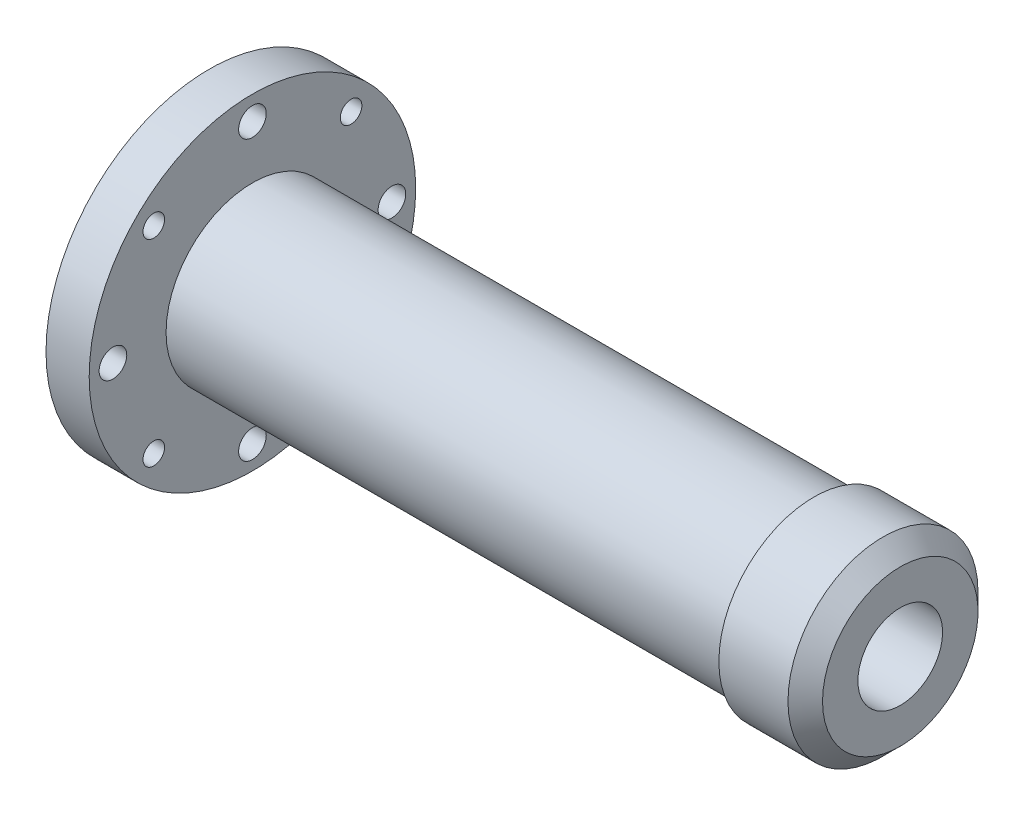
ISO-10303-21;
HEADER;
FILE_DESCRIPTION(('STEP AP214'),'2;1');
FILE_NAME('part.step','',(''),(''),'','','');
FILE_SCHEMA(('AUTOMOTIVE_DESIGN { 1 0 10303 214 1 1 1 1 }'));
ENDSEC;
DATA;
#1=APPLICATION_CONTEXT('core data for automotive mechanical design processes');
#2=APPLICATION_PROTOCOL_DEFINITION('international standard','automotive_design',2000,#1);
#3=PRODUCT_CONTEXT('',#1,'mechanical');
#4=PRODUCT('Part','Part','',(#3));
#5=PRODUCT_RELATED_PRODUCT_CATEGORY('part','',(#4));
#6=PRODUCT_DEFINITION_FORMATION('','',#4);
#7=PRODUCT_DEFINITION_CONTEXT('part definition',#1,'design');
#8=PRODUCT_DEFINITION('design','',#6,#7);
#9=PRODUCT_DEFINITION_SHAPE('','',#8);
#10=(LENGTH_UNIT() NAMED_UNIT(*) SI_UNIT(.MILLI.,.METRE.));
#11=(NAMED_UNIT(*) PLANE_ANGLE_UNIT() SI_UNIT($,.RADIAN.));
#12=(NAMED_UNIT(*) SI_UNIT($,.STERADIAN.) SOLID_ANGLE_UNIT());
#13=UNCERTAINTY_MEASURE_WITH_UNIT(LENGTH_MEASURE(1.E-05),#10,'distance_accuracy_value','');
#14=(GEOMETRIC_REPRESENTATION_CONTEXT(3) GLOBAL_UNCERTAINTY_ASSIGNED_CONTEXT((#13)) GLOBAL_UNIT_ASSIGNED_CONTEXT((#10,
#11,#12)) REPRESENTATION_CONTEXT('',''));
#15=CARTESIAN_POINT('',(0.,0.,0.));
#16=DIRECTION('',(0.,0.,1.));
#17=DIRECTION('',(1.,0.,0.));
#18=AXIS2_PLACEMENT_3D('',#15,#16,#17);
#19=CARTESIAN_POINT('',(0.,13.5,0.));
#20=DIRECTION('',(1.,0.,0.));
#21=DIRECTION('',(0.,0.,-1.));
#22=AXIS2_PLACEMENT_3D('',#19,#20,#21);
#23=PLANE('',#22);
#24=CARTESIAN_POINT('',(0.,-11.4197745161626,11.4197745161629));
#25=DIRECTION('',(-1.,0.,0.));
#26=DIRECTION('',(0.,0.,1.));
#27=AXIS2_PLACEMENT_3D('',#24,#25,#26);
#28=CIRCLE('',#27,1.24999999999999);
#29=CARTESIAN_POINT('',(0.,-11.4197745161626,12.6697745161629));
#30=VERTEX_POINT('',#29);
#31=EDGE_CURVE('E251',#30,#30,#28,.T.);
#32=ORIENTED_EDGE('',*,*,#31,.F.);
#33=EDGE_LOOP('',(#32));
#34=FACE_BOUND('',#33,.T.);
#35=CARTESIAN_POINT('',(0.,11.4197745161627,-11.4197745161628));
#36=DIRECTION('',(-1.,0.,0.));
#37=DIRECTION('',(0.,0.,1.));
#38=AXIS2_PLACEMENT_3D('',#35,#36,#37);
#39=CIRCLE('',#38,1.24999999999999);
#40=CARTESIAN_POINT('',(0.,11.4197745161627,-10.1697745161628));
#41=VERTEX_POINT('',#40);
#42=EDGE_CURVE('E107',#41,#41,#39,.T.);
#43=ORIENTED_EDGE('',*,*,#42,.F.);
#44=EDGE_LOOP('',(#43));
#45=FACE_BOUND('',#44,.T.);
#46=CARTESIAN_POINT('',(0.,0.,-16.15));
#47=DIRECTION('',(1.,0.,0.));
#48=DIRECTION('',(0.,0.,-1.));
#49=AXIS2_PLACEMENT_3D('',#46,#47,#48);
#50=CIRCLE('',#49,1.59999999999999);
#51=CARTESIAN_POINT('',(0.,0.,-17.75));
#52=VERTEX_POINT('',#51);
#53=EDGE_CURVE('E122',#52,#52,#50,.T.);
#54=ORIENTED_EDGE('',*,*,#53,.T.);
#55=EDGE_LOOP('',(#54));
#56=FACE_BOUND('',#55,.T.);
#57=CARTESIAN_POINT('',(0.,0.,0.));
#58=DIRECTION('',(-1.,0.,0.));
#59=DIRECTION('',(0.,0.,1.));
#60=AXIS2_PLACEMENT_3D('',#57,#58,#59);
#61=CIRCLE('',#60,13.5);
#62=CARTESIAN_POINT('',(0.,0.,13.5));
#63=VERTEX_POINT('',#62);
#64=EDGE_CURVE('E157',#63,#63,#61,.T.);
#65=ORIENTED_EDGE('',*,*,#64,.F.);
#66=EDGE_LOOP('',(#65));
#67=FACE_BOUND('',#66,.T.);
#68=CARTESIAN_POINT('',(0.,0.,0.));
#69=DIRECTION('',(-1.,0.,0.));
#70=DIRECTION('',(0.,0.,1.));
#71=AXIS2_PLACEMENT_3D('',#68,#69,#70);
#72=CIRCLE('',#71,18.9);
#73=CARTESIAN_POINT('',(0.,0.,18.9));
#74=VERTEX_POINT('',#73);
#75=EDGE_CURVE('E154',#74,#74,#72,.T.);
#76=ORIENTED_EDGE('',*,*,#75,.T.);
#77=EDGE_LOOP('',(#76));
#78=FACE_BOUND('',#77,.T.);
#79=CARTESIAN_POINT('',(0.,-16.15,0.));
#80=DIRECTION('',(1.,0.,0.));
#81=DIRECTION('',(0.,0.,-1.));
#82=AXIS2_PLACEMENT_3D('',#79,#80,#81);
#83=CIRCLE('',#82,1.59999999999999);
#84=CARTESIAN_POINT('',(0.,-16.15,-1.59999999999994));
#85=VERTEX_POINT('',#84);
#86=EDGE_CURVE('E104',#85,#85,#83,.T.);
#87=ORIENTED_EDGE('',*,*,#86,.T.);
#88=EDGE_LOOP('',(#87));
#89=FACE_BOUND('',#88,.T.);
#90=CARTESIAN_POINT('',(0.,1.12774847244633E-13,16.15));
#91=DIRECTION('',(1.,0.,0.));
#92=DIRECTION('',(0.,0.,-1.));
#93=AXIS2_PLACEMENT_3D('',#90,#91,#92);
#94=CIRCLE('',#93,1.59999999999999);
#95=CARTESIAN_POINT('',(0.,1.12774847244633E-13,14.55));
#96=VERTEX_POINT('',#95);
#97=EDGE_CURVE('E98',#96,#96,#94,.T.);
#98=ORIENTED_EDGE('',*,*,#97,.T.);
#99=EDGE_LOOP('',(#98));
#100=FACE_BOUND('',#99,.T.);
#101=CARTESIAN_POINT('',(0.,16.15,-1.6916227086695E-13));
#102=DIRECTION('',(1.,0.,0.));
#103=DIRECTION('',(0.,0.,-1.));
#104=AXIS2_PLACEMENT_3D('',#101,#102,#103);
#105=CIRCLE('',#104,1.59999999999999);
#106=CARTESIAN_POINT('',(0.,16.15,-1.60000000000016));
#107=VERTEX_POINT('',#106);
#108=EDGE_CURVE('E92',#107,#107,#105,.T.);
#109=ORIENTED_EDGE('',*,*,#108,.T.);
#110=EDGE_LOOP('',(#109));
#111=FACE_BOUND('',#110,.T.);
#112=CARTESIAN_POINT('',(0.,-11.4197745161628,-11.4197745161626));
#113=DIRECTION('',(-1.,0.,0.));
#114=DIRECTION('',(0.,0.,1.));
#115=AXIS2_PLACEMENT_3D('',#112,#113,#114);
#116=CIRCLE('',#115,1.24999999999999);
#117=CARTESIAN_POINT('',(0.,-11.4197745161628,-10.1697745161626));
#118=VERTEX_POINT('',#117);
#119=EDGE_CURVE('E243',#118,#118,#116,.T.);
#120=ORIENTED_EDGE('',*,*,#119,.F.);
#121=EDGE_LOOP('',(#120));
#122=FACE_BOUND('',#121,.T.);
#123=CARTESIAN_POINT('',(0.,11.4197745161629,11.4197745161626));
#124=DIRECTION('',(-1.,0.,0.));
#125=DIRECTION('',(0.,0.,1.));
#126=AXIS2_PLACEMENT_3D('',#123,#124,#125);
#127=CIRCLE('',#126,1.24999999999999);
#128=CARTESIAN_POINT('',(0.,11.4197745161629,12.6697745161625));
#129=VERTEX_POINT('',#128);
#130=EDGE_CURVE('E246',#129,#129,#127,.T.);
#131=ORIENTED_EDGE('',*,*,#130,.F.);
#132=EDGE_LOOP('',(#131));
#133=FACE_BOUND('',#132,.T.);
#134=ADVANCED_FACE('F39',(#34,#45,#56,#67,#78,#89,#100,#111,#122,#133),#23,.F.);
#135=CARTESIAN_POINT('',(5.,18.9,0.));
#136=DIRECTION('',(-1.,0.,0.));
#137=DIRECTION('',(0.,0.,1.));
#138=AXIS2_PLACEMENT_3D('',#135,#136,#137);
#139=PLANE('',#138);
#140=CARTESIAN_POINT('',(5.,11.4197745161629,11.4197745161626));
#141=DIRECTION('',(-1.,0.,0.));
#142=DIRECTION('',(0.,0.,1.));
#143=AXIS2_PLACEMENT_3D('',#140,#141,#142);
#144=CIRCLE('',#143,1.24999999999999);
#145=CARTESIAN_POINT('',(5.,11.4197745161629,12.6697745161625));
#146=VERTEX_POINT('',#145);
#147=EDGE_CURVE('E248',#146,#146,#144,.T.);
#148=ORIENTED_EDGE('',*,*,#147,.T.);
#149=EDGE_LOOP('',(#148));
#150=FACE_BOUND('',#149,.T.);
#151=CARTESIAN_POINT('',(5.,-11.4197745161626,11.4197745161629));
#152=DIRECTION('',(-1.,0.,0.));
#153=DIRECTION('',(0.,0.,1.));
#154=AXIS2_PLACEMENT_3D('',#151,#152,#153);
#155=CIRCLE('',#154,1.24999999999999);
#156=CARTESIAN_POINT('',(5.,-11.4197745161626,12.6697745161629));
#157=VERTEX_POINT('',#156);
#158=EDGE_CURVE('E256',#157,#157,#155,.T.);
#159=ORIENTED_EDGE('',*,*,#158,.T.);
#160=EDGE_LOOP('',(#159));
#161=FACE_BOUND('',#160,.T.);
#162=CARTESIAN_POINT('',(5.,-11.4197745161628,-11.4197745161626));
#163=DIRECTION('',(-1.,0.,0.));
#164=DIRECTION('',(0.,0.,1.));
#165=AXIS2_PLACEMENT_3D('',#162,#163,#164);
#166=CIRCLE('',#165,1.24999999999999);
#167=CARTESIAN_POINT('',(5.,-11.4197745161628,-10.1697745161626));
#168=VERTEX_POINT('',#167);
#169=EDGE_CURVE('E77',#168,#168,#166,.T.);
#170=ORIENTED_EDGE('',*,*,#169,.T.);
#171=EDGE_LOOP('',(#170));
#172=FACE_BOUND('',#171,.T.);
#173=CARTESIAN_POINT('',(5.,16.15,-1.6916227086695E-13));
#174=DIRECTION('',(1.,0.,0.));
#175=DIRECTION('',(0.,0.,-1.));
#176=AXIS2_PLACEMENT_3D('',#173,#174,#175);
#177=CIRCLE('',#176,1.59999999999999);
#178=CARTESIAN_POINT('',(5.,16.15,-1.60000000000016));
#179=VERTEX_POINT('',#178);
#180=EDGE_CURVE('E89',#179,#179,#177,.T.);
#181=ORIENTED_EDGE('',*,*,#180,.F.);
#182=EDGE_LOOP('',(#181));
#183=FACE_BOUND('',#182,.T.);
#184=CARTESIAN_POINT('',(5.,1.12774847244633E-13,16.15));
#185=DIRECTION('',(1.,0.,0.));
#186=DIRECTION('',(0.,0.,-1.));
#187=AXIS2_PLACEMENT_3D('',#184,#185,#186);
#188=CIRCLE('',#187,1.59999999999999);
#189=CARTESIAN_POINT('',(5.,1.12774847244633E-13,14.55));
#190=VERTEX_POINT('',#189);
#191=EDGE_CURVE('E95',#190,#190,#188,.T.);
#192=ORIENTED_EDGE('',*,*,#191,.F.);
#193=EDGE_LOOP('',(#192));
#194=FACE_BOUND('',#193,.T.);
#195=CARTESIAN_POINT('',(5.,0.,-16.15));
#196=DIRECTION('',(1.,0.,0.));
#197=DIRECTION('',(0.,0.,-1.));
#198=AXIS2_PLACEMENT_3D('',#195,#196,#197);
#199=CIRCLE('',#198,1.59999999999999);
#200=CARTESIAN_POINT('',(5.,0.,-17.75));
#201=VERTEX_POINT('',#200);
#202=EDGE_CURVE('E119',#201,#201,#199,.T.);
#203=ORIENTED_EDGE('',*,*,#202,.F.);
#204=EDGE_LOOP('',(#203));
#205=FACE_BOUND('',#204,.T.);
#206=CARTESIAN_POINT('',(5.,0.,0.));
#207=DIRECTION('',(-1.,0.,0.));
#208=DIRECTION('',(0.,0.,1.));
#209=AXIS2_PLACEMENT_3D('',#206,#207,#208);
#210=CIRCLE('',#209,18.9);
#211=CARTESIAN_POINT('',(5.,0.,18.9));
#212=VERTEX_POINT('',#211);
#213=EDGE_CURVE('E151',#212,#212,#210,.T.);
#214=ORIENTED_EDGE('',*,*,#213,.F.);
#215=EDGE_LOOP('',(#214));
#216=FACE_BOUND('',#215,.T.);
#217=CARTESIAN_POINT('',(5.,0.,0.));
#218=DIRECTION('',(-1.,0.,0.));
#219=DIRECTION('',(0.,0.,1.));
#220=AXIS2_PLACEMENT_3D('',#217,#218,#219);
#221=CIRCLE('',#220,10.);
#222=CARTESIAN_POINT('',(5.,0.,10.));
#223=VERTEX_POINT('',#222);
#224=EDGE_CURVE('E148',#223,#223,#221,.T.);
#225=ORIENTED_EDGE('',*,*,#224,.T.);
#226=EDGE_LOOP('',(#225));
#227=FACE_BOUND('',#226,.T.);
#228=CARTESIAN_POINT('',(5.,11.4197745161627,-11.4197745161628));
#229=DIRECTION('',(-1.,0.,0.));
#230=DIRECTION('',(0.,0.,1.));
#231=AXIS2_PLACEMENT_3D('',#228,#229,#230);
#232=CIRCLE('',#231,1.24999999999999);
#233=CARTESIAN_POINT('',(5.,11.4197745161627,-10.1697745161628));
#234=VERTEX_POINT('',#233);
#235=EDGE_CURVE('E110',#234,#234,#232,.T.);
#236=ORIENTED_EDGE('',*,*,#235,.T.);
#237=EDGE_LOOP('',(#236));
#238=FACE_BOUND('',#237,.T.);
#239=CARTESIAN_POINT('',(5.,-16.15,0.));
#240=DIRECTION('',(1.,0.,0.));
#241=DIRECTION('',(0.,0.,-1.));
#242=AXIS2_PLACEMENT_3D('',#239,#240,#241);
#243=CIRCLE('',#242,1.59999999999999);
#244=CARTESIAN_POINT('',(5.,-16.15,-1.59999999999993));
#245=VERTEX_POINT('',#244);
#246=EDGE_CURVE('E101',#245,#245,#243,.T.);
#247=ORIENTED_EDGE('',*,*,#246,.F.);
#248=EDGE_LOOP('',(#247));
#249=FACE_BOUND('',#248,.T.);
#250=ADVANCED_FACE('F185',(#150,#161,#172,#183,#194,#205,#216,#227,#238,#249),#139,.F.);
#251=CARTESIAN_POINT('',(0.,5.,0.));
#252=DIRECTION('',(1.,0.,0.));
#253=DIRECTION('',(0.,0.,-1.));
#254=AXIS2_PLACEMENT_3D('',#251,#252,#253);
#255=PLANE('',#254);
#256=CARTESIAN_POINT('',(0.,0.,0.));
#257=DIRECTION('',(1.,0.,0.));
#258=DIRECTION('',(0.,0.,-1.));
#259=AXIS2_PLACEMENT_3D('',#256,#257,#258);
#260=CIRCLE('',#259,5.50000000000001);
#261=CARTESIAN_POINT('',(0.,0.,-5.50000000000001));
#262=VERTEX_POINT('',#261);
#263=EDGE_CURVE('E11',#262,#262,#260,.T.);
#264=ORIENTED_EDGE('',*,*,#263,.T.);
#265=EDGE_LOOP('',(#264));
#266=FACE_BOUND('',#265,.T.);
#267=CARTESIAN_POINT('',(0.,0.,7.5));
#268=DIRECTION('',(-1.,0.,0.));
#269=DIRECTION('',(0.,0.,1.));
#270=AXIS2_PLACEMENT_3D('',#267,#268,#269);
#271=CIRCLE('',#270,1.025);
#272=CARTESIAN_POINT('',(0.,0.,8.525));
#273=VERTEX_POINT('',#272);
#274=EDGE_CURVE('E71',#273,#273,#271,.T.);
#275=ORIENTED_EDGE('',*,*,#274,.F.);
#276=EDGE_LOOP('',(#275));
#277=FACE_BOUND('',#276,.T.);
#278=CARTESIAN_POINT('',(0.,-7.5,0.));
#279=DIRECTION('',(-1.,0.,0.));
#280=DIRECTION('',(0.,0.,1.));
#281=AXIS2_PLACEMENT_3D('',#278,#279,#280);
#282=CIRCLE('',#281,1.025);
#283=CARTESIAN_POINT('',(0.,-7.5,1.02500000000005));
#284=VERTEX_POINT('',#283);
#285=EDGE_CURVE('E70',#284,#284,#282,.T.);
#286=ORIENTED_EDGE('',*,*,#285,.F.);
#287=EDGE_LOOP('',(#286));
#288=FACE_BOUND('',#287,.T.);
#289=CARTESIAN_POINT('',(0.,0.,-7.5));
#290=DIRECTION('',(-1.,0.,0.));
#291=DIRECTION('',(0.,0.,1.));
#292=AXIS2_PLACEMENT_3D('',#289,#290,#291);
#293=CIRCLE('',#292,1.025);
#294=CARTESIAN_POINT('',(0.,0.,-6.475));
#295=VERTEX_POINT('',#294);
#296=EDGE_CURVE('E83',#295,#295,#293,.T.);
#297=ORIENTED_EDGE('',*,*,#296,.F.);
#298=EDGE_LOOP('',(#297));
#299=FACE_BOUND('',#298,.T.);
#300=CARTESIAN_POINT('',(0.,7.5,0.));
#301=DIRECTION('',(-1.,0.,0.));
#302=DIRECTION('',(0.,0.,1.));
#303=AXIS2_PLACEMENT_3D('',#300,#301,#302);
#304=CIRCLE('',#303,1.025);
#305=CARTESIAN_POINT('',(0.,7.5,1.025));
#306=VERTEX_POINT('',#305);
#307=EDGE_CURVE('E113',#306,#306,#304,.T.);
#308=ORIENTED_EDGE('',*,*,#307,.F.);
#309=EDGE_LOOP('',(#308));
#310=FACE_BOUND('',#309,.T.);
#311=CARTESIAN_POINT('',(0.,0.,0.));
#312=DIRECTION('',(-1.,0.,0.));
#313=DIRECTION('',(0.,0.,1.));
#314=AXIS2_PLACEMENT_3D('',#311,#312,#313);
#315=CIRCLE('',#314,10.);
#316=CARTESIAN_POINT('',(0.,0.,10.));
#317=VERTEX_POINT('',#316);
#318=EDGE_CURVE('E166',#317,#317,#315,.T.);
#319=ORIENTED_EDGE('',*,*,#318,.T.);
#320=EDGE_LOOP('',(#319));
#321=FACE_BOUND('',#320,.T.);
#322=ADVANCED_FACE('F191',(#266,#277,#288,#299,#310,#321),#255,.F.);
#323=CARTESIAN_POINT('',(0.,0.,0.));
#324=DIRECTION('',(-1.,0.,0.));
#325=DIRECTION('',(0.,0.,1.));
#326=AXIS2_PLACEMENT_3D('',#323,#324,#325);
#327=CYLINDRICAL_SURFACE('',#326,10.);
#328=ORIENTED_EDGE('',*,*,#318,.F.);
#329=EDGE_LOOP('',(#328));
#330=FACE_BOUND('',#329,.T.);
#331=CARTESIAN_POINT('',(4.3,0.,0.));
#332=DIRECTION('',(-1.,0.,0.));
#333=DIRECTION('',(0.,0.,1.));
#334=AXIS2_PLACEMENT_3D('',#331,#332,#333);
#335=CIRCLE('',#334,10.);
#336=CARTESIAN_POINT('',(4.3,0.,10.));
#337=VERTEX_POINT('',#336);
#338=EDGE_CURVE('E163',#337,#337,#335,.T.);
#339=ORIENTED_EDGE('',*,*,#338,.T.);
#340=EDGE_LOOP('',(#339));
#341=FACE_BOUND('',#340,.T.);
#342=ADVANCED_FACE('F206',(#330,#341),#327,.T.);
#343=CARTESIAN_POINT('',(4.3,10.,0.));
#344=DIRECTION('',(1.,0.,0.));
#345=DIRECTION('',(0.,0.,-1.));
#346=AXIS2_PLACEMENT_3D('',#343,#344,#345);
#347=PLANE('',#346);
#348=ORIENTED_EDGE('',*,*,#338,.F.);
#349=EDGE_LOOP('',(#348));
#350=FACE_BOUND('',#349,.T.);
#351=CARTESIAN_POINT('',(4.3,0.,0.));
#352=DIRECTION('',(-1.,0.,0.));
#353=DIRECTION('',(0.,0.,1.));
#354=AXIS2_PLACEMENT_3D('',#351,#352,#353);
#355=CIRCLE('',#354,13.5);
#356=CARTESIAN_POINT('',(4.3,0.,13.5));
#357=VERTEX_POINT('',#356);
#358=EDGE_CURVE('E160',#357,#357,#355,.T.);
#359=ORIENTED_EDGE('',*,*,#358,.T.);
#360=EDGE_LOOP('',(#359));
#361=FACE_BOUND('',#360,.T.);
#362=ADVANCED_FACE('F202',(#350,#361),#347,.F.);
#363=CARTESIAN_POINT('',(0.,0.,0.));
#364=DIRECTION('',(-1.,0.,0.));
#365=DIRECTION('',(0.,0.,1.));
#366=AXIS2_PLACEMENT_3D('',#363,#364,#365);
#367=CYLINDRICAL_SURFACE('',#366,13.5);
#368=ORIENTED_EDGE('',*,*,#358,.F.);
#369=EDGE_LOOP('',(#368));
#370=FACE_BOUND('',#369,.T.);
#371=ORIENTED_EDGE('',*,*,#64,.T.);
#372=EDGE_LOOP('',(#371));
#373=FACE_BOUND('',#372,.T.);
#374=ADVANCED_FACE('F199',(#370,#373),#367,.F.);
#375=CARTESIAN_POINT('',(0.,0.,0.));
#376=DIRECTION('',(-1.,0.,0.));
#377=DIRECTION('',(0.,0.,1.));
#378=AXIS2_PLACEMENT_3D('',#375,#376,#377);
#379=CYLINDRICAL_SURFACE('',#378,18.9);
#380=ORIENTED_EDGE('',*,*,#75,.F.);
#381=EDGE_LOOP('',(#380));
#382=FACE_BOUND('',#381,.T.);
#383=ORIENTED_EDGE('',*,*,#213,.T.);
#384=EDGE_LOOP('',(#383));
#385=FACE_BOUND('',#384,.T.);
#386=ADVANCED_FACE('F198',(#382,#385),#379,.T.);
#387=CARTESIAN_POINT('',(0.,0.,0.));
#388=DIRECTION('',(-1.,0.,0.));
#389=DIRECTION('',(0.,0.,1.));
#390=AXIS2_PLACEMENT_3D('',#387,#388,#389);
#391=CYLINDRICAL_SURFACE('',#390,10.);
#392=ORIENTED_EDGE('',*,*,#224,.F.);
#393=EDGE_LOOP('',(#392));
#394=FACE_BOUND('',#393,.T.);
#395=CARTESIAN_POINT('',(70.,0.,0.));
#396=DIRECTION('',(-1.,0.,0.));
#397=DIRECTION('',(0.,0.,1.));
#398=AXIS2_PLACEMENT_3D('',#395,#396,#397);
#399=CIRCLE('',#398,10.);
#400=CARTESIAN_POINT('',(70.,0.,10.));
#401=VERTEX_POINT('',#400);
#402=EDGE_CURVE('E145',#401,#401,#399,.T.);
#403=ORIENTED_EDGE('',*,*,#402,.T.);
#404=EDGE_LOOP('',(#403));
#405=FACE_BOUND('',#404,.T.);
#406=ADVANCED_FACE('F342',(#394,#405),#391,.T.);
#407=CARTESIAN_POINT('',(70.,10.,0.));
#408=DIRECTION('',(1.,0.,0.));
#409=DIRECTION('',(0.,0.,-1.));
#410=AXIS2_PLACEMENT_3D('',#407,#408,#409);
#411=PLANE('',#410);
#412=ORIENTED_EDGE('',*,*,#402,.F.);
#413=EDGE_LOOP('',(#412));
#414=FACE_BOUND('',#413,.T.);
#415=CARTESIAN_POINT('',(70.,0.,0.));
#416=DIRECTION('',(-1.,0.,0.));
#417=DIRECTION('',(0.,0.,1.));
#418=AXIS2_PLACEMENT_3D('',#415,#416,#417);
#419=CIRCLE('',#418,11.);
#420=CARTESIAN_POINT('',(70.,0.,11.));
#421=VERTEX_POINT('',#420);
#422=EDGE_CURVE('E142',#421,#421,#419,.T.);
#423=ORIENTED_EDGE('',*,*,#422,.T.);
#424=EDGE_LOOP('',(#423));
#425=FACE_BOUND('',#424,.T.);
#426=ADVANCED_FACE('F338',(#414,#425),#411,.F.);
#427=CARTESIAN_POINT('',(0.,0.,0.));
#428=DIRECTION('',(-1.,0.,0.));
#429=DIRECTION('',(0.,0.,1.));
#430=AXIS2_PLACEMENT_3D('',#427,#428,#429);
#431=CYLINDRICAL_SURFACE('',#430,11.);
#432=ORIENTED_EDGE('',*,*,#422,.F.);
#433=EDGE_LOOP('',(#432));
#434=FACE_BOUND('',#433,.T.);
#435=CARTESIAN_POINT('',(78.,0.,0.));
#436=DIRECTION('',(-1.,0.,0.));
#437=DIRECTION('',(0.,0.,1.));
#438=AXIS2_PLACEMENT_3D('',#435,#436,#437);
#439=CIRCLE('',#438,11.);
#440=CARTESIAN_POINT('',(78.,0.,11.));
#441=VERTEX_POINT('',#440);
#442=EDGE_CURVE('E139',#441,#441,#439,.T.);
#443=ORIENTED_EDGE('',*,*,#442,.T.);
#444=EDGE_LOOP('',(#443));
#445=FACE_BOUND('',#444,.T.);
#446=ADVANCED_FACE('F334',(#434,#445),#431,.T.);
#447=CARTESIAN_POINT('',(80.,0.,0.));
#448=DIRECTION('',(-1.,0.,0.));
#449=DIRECTION('',(0.,0.,1.));
#450=AXIS2_PLACEMENT_3D('',#447,#448,#449);
#451=CONICAL_SURFACE('',#450,8.99999999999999,0.78539816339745);
#452=ORIENTED_EDGE('',*,*,#442,.F.);
#453=EDGE_LOOP('',(#452));
#454=FACE_BOUND('',#453,.T.);
#455=CARTESIAN_POINT('',(80.,0.,0.));
#456=DIRECTION('',(-1.,0.,0.));
#457=DIRECTION('',(0.,0.,1.));
#458=AXIS2_PLACEMENT_3D('',#455,#456,#457);
#459=CIRCLE('',#458,8.99999999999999);
#460=CARTESIAN_POINT('',(80.,0.,8.99999999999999));
#461=VERTEX_POINT('',#460);
#462=EDGE_CURVE('E136',#461,#461,#459,.T.);
#463=ORIENTED_EDGE('',*,*,#462,.T.);
#464=EDGE_LOOP('',(#463));
#465=FACE_BOUND('',#464,.T.);
#466=ADVANCED_FACE('F330',(#454,#465),#451,.T.);
#467=CARTESIAN_POINT('',(80.,8.99999999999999,0.));
#468=DIRECTION('',(-1.,0.,0.));
#469=DIRECTION('',(0.,0.,1.));
#470=AXIS2_PLACEMENT_3D('',#467,#468,#469);
#471=PLANE('',#470);
#472=ORIENTED_EDGE('',*,*,#462,.F.);
#473=EDGE_LOOP('',(#472));
#474=FACE_BOUND('',#473,.T.);
#475=CARTESIAN_POINT('',(80.,0.,0.));
#476=DIRECTION('',(-1.,0.,0.));
#477=DIRECTION('',(0.,0.,1.));
#478=AXIS2_PLACEMENT_3D('',#475,#476,#477);
#479=CIRCLE('',#478,4.9);
#480=CARTESIAN_POINT('',(80.,0.,4.9));
#481=VERTEX_POINT('',#480);
#482=EDGE_CURVE('E133',#481,#481,#479,.T.);
#483=ORIENTED_EDGE('',*,*,#482,.T.);
#484=EDGE_LOOP('',(#483));
#485=FACE_BOUND('',#484,.T.);
#486=ADVANCED_FACE('F326',(#474,#485),#471,.F.);
#487=CARTESIAN_POINT('',(0.,0.,0.));
#488=DIRECTION('',(-1.,0.,0.));
#489=DIRECTION('',(0.,0.,1.));
#490=AXIS2_PLACEMENT_3D('',#487,#488,#489);
#491=CYLINDRICAL_SURFACE('',#490,4.9);
#492=ORIENTED_EDGE('',*,*,#482,.F.);
#493=EDGE_LOOP('',(#492));
#494=FACE_BOUND('',#493,.T.);
#495=CARTESIAN_POINT('',(15.,0.,0.));
#496=DIRECTION('',(-1.,0.,0.));
#497=DIRECTION('',(0.,0.,1.));
#498=AXIS2_PLACEMENT_3D('',#495,#496,#497);
#499=CIRCLE('',#498,4.9);
#500=CARTESIAN_POINT('',(15.,0.,4.9));
#501=VERTEX_POINT('',#500);
#502=EDGE_CURVE('E129',#501,#501,#499,.T.);
#503=ORIENTED_EDGE('',*,*,#502,.T.);
#504=EDGE_LOOP('',(#503));
#505=FACE_BOUND('',#504,.T.);
#506=ADVANCED_FACE('F322',(#494,#505),#491,.F.);
#507=CARTESIAN_POINT('',(15.,5.,0.));
#508=DIRECTION('',(1.,0.,0.));
#509=DIRECTION('',(0.,0.,-1.));
#510=AXIS2_PLACEMENT_3D('',#507,#508,#509);
#511=PLANE('',#510);
#512=ORIENTED_EDGE('',*,*,#502,.F.);
#513=EDGE_LOOP('',(#512));
#514=FACE_BOUND('',#513,.T.);
#515=CARTESIAN_POINT('',(15.,0.,0.));
#516=DIRECTION('',(-1.,0.,0.));
#517=DIRECTION('',(0.,0.,1.));
#518=AXIS2_PLACEMENT_3D('',#515,#516,#517);
#519=CIRCLE('',#518,5.);
#520=CARTESIAN_POINT('',(15.,0.,5.));
#521=VERTEX_POINT('',#520);
#522=EDGE_CURVE('E125',#521,#521,#519,.T.);
#523=ORIENTED_EDGE('',*,*,#522,.T.);
#524=EDGE_LOOP('',(#523));
#525=FACE_BOUND('',#524,.T.);
#526=ADVANCED_FACE('F319',(#514,#525),#511,.F.);
#527=CARTESIAN_POINT('',(0.,0.,0.));
#528=DIRECTION('',(-1.,0.,0.));
#529=DIRECTION('',(0.,0.,1.));
#530=AXIS2_PLACEMENT_3D('',#527,#528,#529);
#531=CYLINDRICAL_SURFACE('',#530,5.);
#532=CARTESIAN_POINT('',(0.500000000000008,0.,0.));
#533=DIRECTION('',(1.,0.,0.));
#534=DIRECTION('',(0.,0.,-1.));
#535=AXIS2_PLACEMENT_3D('',#532,#533,#534);
#536=CIRCLE('',#535,5.);
#537=CARTESIAN_POINT('',(0.500000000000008,0.,-5.));
#538=VERTEX_POINT('',#537);
#539=EDGE_CURVE('E47',#538,#538,#536,.F.);
#540=ORIENTED_EDGE('',*,*,#539,.T.);
#541=EDGE_LOOP('',(#540));
#542=FACE_BOUND('',#541,.T.);
#543=ORIENTED_EDGE('',*,*,#522,.F.);
#544=EDGE_LOOP('',(#543));
#545=FACE_BOUND('',#544,.T.);
#546=ADVANCED_FACE('F171',(#542,#545),#531,.F.);
#547=CARTESIAN_POINT('',(5.,0.,-16.15));
#548=DIRECTION('',(1.,0.,0.));
#549=DIRECTION('',(0.,0.,-1.));
#550=AXIS2_PLACEMENT_3D('',#547,#548,#549);
#551=CYLINDRICAL_SURFACE('',#550,1.59999999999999);
#552=ORIENTED_EDGE('',*,*,#53,.F.);
#553=EDGE_LOOP('',(#552));
#554=FACE_BOUND('',#553,.T.);
#555=ORIENTED_EDGE('',*,*,#202,.T.);
#556=EDGE_LOOP('',(#555));
#557=FACE_BOUND('',#556,.T.);
#558=ADVANCED_FACE('F313',(#554,#557),#551,.F.);
#559=CARTESIAN_POINT('',(7.25,7.5,0.));
#560=DIRECTION('',(-1.,0.,0.));
#561=DIRECTION('',(0.,0.,1.));
#562=AXIS2_PLACEMENT_3D('',#559,#560,#561);
#563=CONICAL_SURFACE('',#562,1.025,1.02974425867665);
#564=CARTESIAN_POINT('',(7.86588213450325,7.5,0.));
#565=VERTEX_POINT('',#564);
#566=VERTEX_LOOP('',#565);
#567=FACE_BOUND('',#566,.T.);
#568=CARTESIAN_POINT('',(7.25,7.5,0.));
#569=DIRECTION('',(-1.,0.,0.));
#570=DIRECTION('',(0.,0.,1.));
#571=AXIS2_PLACEMENT_3D('',#568,#569,#570);
#572=CIRCLE('',#571,1.025);
#573=CARTESIAN_POINT('',(7.25,7.5,1.025));
#574=VERTEX_POINT('',#573);
#575=EDGE_CURVE('E116',#574,#574,#572,.T.);
#576=ORIENTED_EDGE('',*,*,#575,.T.);
#577=EDGE_LOOP('',(#576));
#578=FACE_BOUND('',#577,.T.);
#579=ADVANCED_FACE('F309',(#567,#578),#563,.F.);
#580=CARTESIAN_POINT('',(0.,7.5,0.));
#581=DIRECTION('',(-1.,0.,0.));
#582=DIRECTION('',(0.,0.,1.));
#583=AXIS2_PLACEMENT_3D('',#580,#581,#582);
#584=CYLINDRICAL_SURFACE('',#583,1.025);
#585=ORIENTED_EDGE('',*,*,#575,.F.);
#586=EDGE_LOOP('',(#585));
#587=FACE_BOUND('',#586,.T.);
#588=ORIENTED_EDGE('',*,*,#307,.T.);
#589=EDGE_LOOP('',(#588));
#590=FACE_BOUND('',#589,.T.);
#591=ADVANCED_FACE('F305',(#587,#590),#584,.F.);
#592=CARTESIAN_POINT('',(0.,11.4197745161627,-11.4197745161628));
#593=DIRECTION('',(-1.,0.,0.));
#594=DIRECTION('',(0.,0.,1.));
#595=AXIS2_PLACEMENT_3D('',#592,#593,#594);
#596=CYLINDRICAL_SURFACE('',#595,1.24999999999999);
#597=ORIENTED_EDGE('',*,*,#235,.F.);
#598=EDGE_LOOP('',(#597));
#599=FACE_BOUND('',#598,.T.);
#600=ORIENTED_EDGE('',*,*,#42,.T.);
#601=EDGE_LOOP('',(#600));
#602=FACE_BOUND('',#601,.T.);
#603=ADVANCED_FACE('F301',(#599,#602),#596,.F.);
#604=CARTESIAN_POINT('',(5.,-16.15,0.));
#605=DIRECTION('',(1.,0.,0.));
#606=DIRECTION('',(0.,0.,-1.));
#607=AXIS2_PLACEMENT_3D('',#604,#605,#606);
#608=CYLINDRICAL_SURFACE('',#607,1.59999999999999);
#609=ORIENTED_EDGE('',*,*,#86,.F.);
#610=EDGE_LOOP('',(#609));
#611=FACE_BOUND('',#610,.T.);
#612=ORIENTED_EDGE('',*,*,#246,.T.);
#613=EDGE_LOOP('',(#612));
#614=FACE_BOUND('',#613,.T.);
#615=ADVANCED_FACE('F297',(#611,#614),#608,.F.);
#616=CARTESIAN_POINT('',(5.,1.12774847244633E-13,16.15));
#617=DIRECTION('',(1.,0.,0.));
#618=DIRECTION('',(0.,0.,-1.));
#619=AXIS2_PLACEMENT_3D('',#616,#617,#618);
#620=CYLINDRICAL_SURFACE('',#619,1.59999999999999);
#621=ORIENTED_EDGE('',*,*,#97,.F.);
#622=EDGE_LOOP('',(#621));
#623=FACE_BOUND('',#622,.T.);
#624=ORIENTED_EDGE('',*,*,#191,.T.);
#625=EDGE_LOOP('',(#624));
#626=FACE_BOUND('',#625,.T.);
#627=ADVANCED_FACE('F293',(#623,#626),#620,.F.);
#628=CARTESIAN_POINT('',(5.,16.15,-1.6916227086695E-13));
#629=DIRECTION('',(1.,0.,0.));
#630=DIRECTION('',(0.,0.,-1.));
#631=AXIS2_PLACEMENT_3D('',#628,#629,#630);
#632=CYLINDRICAL_SURFACE('',#631,1.59999999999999);
#633=ORIENTED_EDGE('',*,*,#108,.F.);
#634=EDGE_LOOP('',(#633));
#635=FACE_BOUND('',#634,.T.);
#636=ORIENTED_EDGE('',*,*,#180,.T.);
#637=EDGE_LOOP('',(#636));
#638=FACE_BOUND('',#637,.T.);
#639=ADVANCED_FACE('F290',(#635,#638),#632,.F.);
#640=CARTESIAN_POINT('',(7.25,0.,-7.5));
#641=DIRECTION('',(-1.,0.,0.));
#642=DIRECTION('',(0.,0.,1.));
#643=AXIS2_PLACEMENT_3D('',#640,#641,#642);
#644=CONICAL_SURFACE('',#643,1.025,1.02974425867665);
#645=CARTESIAN_POINT('',(7.86588213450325,0.,-7.5));
#646=VERTEX_POINT('',#645);
#647=VERTEX_LOOP('',#646);
#648=FACE_BOUND('',#647,.T.);
#649=CARTESIAN_POINT('',(7.25,0.,-7.5));
#650=DIRECTION('',(-1.,0.,0.));
#651=DIRECTION('',(0.,0.,1.));
#652=AXIS2_PLACEMENT_3D('',#649,#650,#651);
#653=CIRCLE('',#652,1.025);
#654=CARTESIAN_POINT('',(7.25,0.,-6.475));
#655=VERTEX_POINT('',#654);
#656=EDGE_CURVE('E86',#655,#655,#653,.T.);
#657=ORIENTED_EDGE('',*,*,#656,.T.);
#658=EDGE_LOOP('',(#657));
#659=FACE_BOUND('',#658,.T.);
#660=ADVANCED_FACE('F286',(#648,#659),#644,.F.);
#661=CARTESIAN_POINT('',(0.,0.,-7.5));
#662=DIRECTION('',(-1.,0.,0.));
#663=DIRECTION('',(0.,0.,1.));
#664=AXIS2_PLACEMENT_3D('',#661,#662,#663);
#665=CYLINDRICAL_SURFACE('',#664,1.025);
#666=ORIENTED_EDGE('',*,*,#656,.F.);
#667=EDGE_LOOP('',(#666));
#668=FACE_BOUND('',#667,.T.);
#669=ORIENTED_EDGE('',*,*,#296,.T.);
#670=EDGE_LOOP('',(#669));
#671=FACE_BOUND('',#670,.T.);
#672=ADVANCED_FACE('F282',(#668,#671),#665,.F.);
#673=CARTESIAN_POINT('',(7.25,-7.5,0.));
#674=DIRECTION('',(-1.,0.,0.));
#675=DIRECTION('',(0.,0.,1.));
#676=AXIS2_PLACEMENT_3D('',#673,#674,#675);
#677=CONICAL_SURFACE('',#676,1.025,1.02974425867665);
#678=CARTESIAN_POINT('',(7.86588213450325,-7.5,0.));
#679=VERTEX_POINT('',#678);
#680=VERTEX_LOOP('',#679);
#681=FACE_BOUND('',#680,.T.);
#682=CARTESIAN_POINT('',(7.25,-7.5,0.));
#683=DIRECTION('',(-1.,0.,0.));
#684=DIRECTION('',(0.,0.,1.));
#685=AXIS2_PLACEMENT_3D('',#682,#683,#684);
#686=CIRCLE('',#685,1.025);
#687=CARTESIAN_POINT('',(7.25,-7.5,1.02500000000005));
#688=VERTEX_POINT('',#687);
#689=EDGE_CURVE('E74',#688,#688,#686,.T.);
#690=ORIENTED_EDGE('',*,*,#689,.T.);
#691=EDGE_LOOP('',(#690));
#692=FACE_BOUND('',#691,.T.);
#693=ADVANCED_FACE('F278',(#681,#692),#677,.F.);
#694=CARTESIAN_POINT('',(0.,-7.5,0.));
#695=DIRECTION('',(-1.,0.,0.));
#696=DIRECTION('',(0.,0.,1.));
#697=AXIS2_PLACEMENT_3D('',#694,#695,#696);
#698=CYLINDRICAL_SURFACE('',#697,1.025);
#699=ORIENTED_EDGE('',*,*,#689,.F.);
#700=EDGE_LOOP('',(#699));
#701=FACE_BOUND('',#700,.T.);
#702=ORIENTED_EDGE('',*,*,#285,.T.);
#703=EDGE_LOOP('',(#702));
#704=FACE_BOUND('',#703,.T.);
#705=ADVANCED_FACE('F64',(#701,#704),#698,.F.);
#706=CARTESIAN_POINT('',(7.25,0.,7.5));
#707=DIRECTION('',(-1.,0.,0.));
#708=DIRECTION('',(0.,0.,1.));
#709=AXIS2_PLACEMENT_3D('',#706,#707,#708);
#710=CONICAL_SURFACE('',#709,1.025,1.02974425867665);
#711=CARTESIAN_POINT('',(7.86588213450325,0.,7.5));
#712=VERTEX_POINT('',#711);
#713=VERTEX_LOOP('',#712);
#714=FACE_BOUND('',#713,.T.);
#715=CARTESIAN_POINT('',(7.25,0.,7.5));
#716=DIRECTION('',(-1.,0.,0.));
#717=DIRECTION('',(0.,0.,1.));
#718=AXIS2_PLACEMENT_3D('',#715,#716,#717);
#719=CIRCLE('',#718,1.025);
#720=CARTESIAN_POINT('',(7.25,0.,8.525));
#721=VERTEX_POINT('',#720);
#722=EDGE_CURVE('E68',#721,#721,#719,.T.);
#723=ORIENTED_EDGE('',*,*,#722,.T.);
#724=EDGE_LOOP('',(#723));
#725=FACE_BOUND('',#724,.T.);
#726=ADVANCED_FACE('F60',(#714,#725),#710,.F.);
#727=CARTESIAN_POINT('',(0.,0.,7.5));
#728=DIRECTION('',(-1.,0.,0.));
#729=DIRECTION('',(0.,0.,1.));
#730=AXIS2_PLACEMENT_3D('',#727,#728,#729);
#731=CYLINDRICAL_SURFACE('',#730,1.025);
#732=ORIENTED_EDGE('',*,*,#722,.F.);
#733=EDGE_LOOP('',(#732));
#734=FACE_BOUND('',#733,.T.);
#735=ORIENTED_EDGE('',*,*,#274,.T.);
#736=EDGE_LOOP('',(#735));
#737=FACE_BOUND('',#736,.T.);
#738=ADVANCED_FACE('F63',(#734,#737),#731,.F.);
#739=CARTESIAN_POINT('',(0.,-11.4197745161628,-11.4197745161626));
#740=DIRECTION('',(-1.,0.,0.));
#741=DIRECTION('',(0.,0.,1.));
#742=AXIS2_PLACEMENT_3D('',#739,#740,#741);
#743=CYLINDRICAL_SURFACE('',#742,1.24999999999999);
#744=ORIENTED_EDGE('',*,*,#169,.F.);
#745=EDGE_LOOP('',(#744));
#746=FACE_BOUND('',#745,.T.);
#747=ORIENTED_EDGE('',*,*,#119,.T.);
#748=EDGE_LOOP('',(#747));
#749=FACE_BOUND('',#748,.T.);
#750=ADVANCED_FACE('F264',(#746,#749),#743,.F.);
#751=CARTESIAN_POINT('',(0.,-11.4197745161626,11.4197745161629));
#752=DIRECTION('',(-1.,0.,0.));
#753=DIRECTION('',(0.,0.,1.));
#754=AXIS2_PLACEMENT_3D('',#751,#752,#753);
#755=CYLINDRICAL_SURFACE('',#754,1.24999999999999);
#756=ORIENTED_EDGE('',*,*,#158,.F.);
#757=EDGE_LOOP('',(#756));
#758=FACE_BOUND('',#757,.T.);
#759=ORIENTED_EDGE('',*,*,#31,.T.);
#760=EDGE_LOOP('',(#759));
#761=FACE_BOUND('',#760,.T.);
#762=ADVANCED_FACE('F180',(#758,#761),#755,.F.);
#763=CARTESIAN_POINT('',(0.,11.4197745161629,11.4197745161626));
#764=DIRECTION('',(-1.,0.,0.));
#765=DIRECTION('',(0.,0.,1.));
#766=AXIS2_PLACEMENT_3D('',#763,#764,#765);
#767=CYLINDRICAL_SURFACE('',#766,1.24999999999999);
#768=ORIENTED_EDGE('',*,*,#147,.F.);
#769=EDGE_LOOP('',(#768));
#770=FACE_BOUND('',#769,.T.);
#771=ORIENTED_EDGE('',*,*,#130,.T.);
#772=EDGE_LOOP('',(#771));
#773=FACE_BOUND('',#772,.T.);
#774=ADVANCED_FACE('F175',(#770,#773),#767,.F.);
#775=CARTESIAN_POINT('',(0.500000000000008,0.,0.));
#776=DIRECTION('',(-1.,0.,0.));
#777=DIRECTION('',(0.,0.,1.));
#778=AXIS2_PLACEMENT_3D('',#775,#776,#777);
#779=CONICAL_SURFACE('',#778,5.,0.785398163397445);
#780=ORIENTED_EDGE('',*,*,#263,.F.);
#781=EDGE_LOOP('',(#780));
#782=FACE_BOUND('',#781,.T.);
#783=ORIENTED_EDGE('',*,*,#539,.F.);
#784=EDGE_LOOP('',(#783));
#785=FACE_BOUND('',#784,.T.);
#786=ADVANCED_FACE('F41',(#782,#785),#779,.F.);
#787=CLOSED_SHELL('',(#134,#250,#322,#342,#362,#374,#386,#406,#426,#446,#466,#486,#506,#526,
#546,#558,#579,#591,#603,#615,#627,#639,#660,#672,#693,#705,#726,#738,#750,#762,#774,#786));
#788=MANIFOLD_SOLID_BREP('B2',#787);
#789=ADVANCED_BREP_SHAPE_REPRESENTATION('',(#18,#788),#14);
#790=SHAPE_DEFINITION_REPRESENTATION(#9,#789);
ENDSEC;
END-ISO-10303-21;
